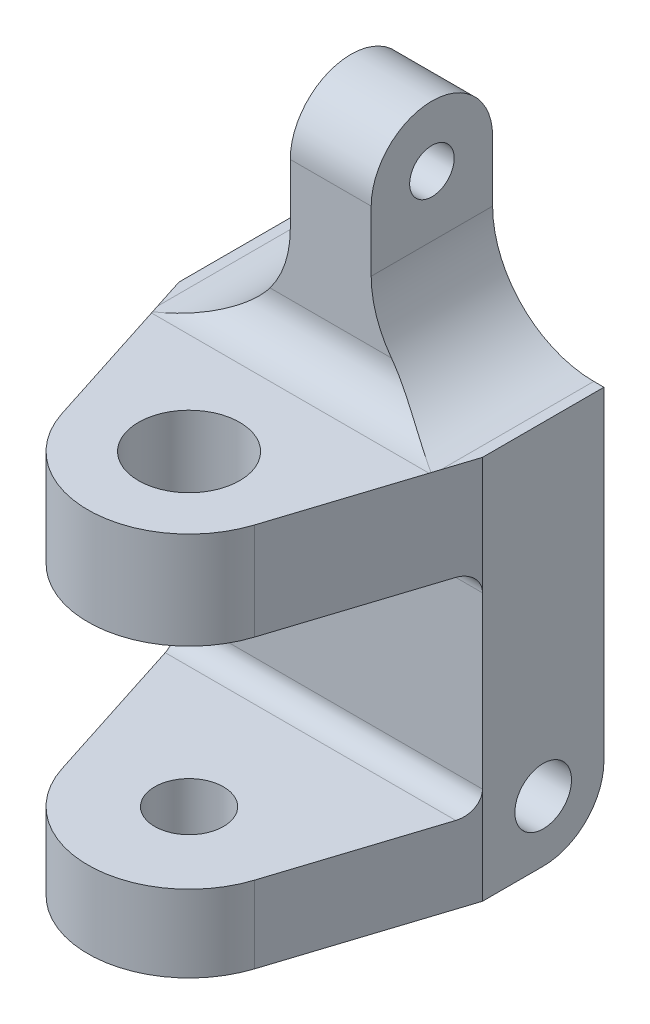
from build123d import *

# Parameters (mm, degrees)
BOSS_EXTRUDE1_DEPTH      = 9.525
BOSS_EXTRUDE6_DEPTH      = 15.24
BOSS_EXTRUDE6_DEPTH_BACK = 19.05
CUT_EXTRUDE1_DEPTH       = 29.575
CUT_EXTRUDE1_DEPTH_BACK  = 29.575
SKETCH9_R                = 1.397
SKETCH9_R_2              = 1.778
CUT_EXTRUDE2_DEPTH       = 33.995567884
SKETCH10_R               = 2.159
CUT_EXTRUDE3_DEPTH       = 33.18516778
CUT_EXTRUDE4_DEPTH       = 27.189420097
CUT_EXTRUDE4_DEPTH_BACK  = 27.189420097
SKETCH14_R               = 3.175
CUT_EXTRUDE5_DEPTH       = 5.08
CUT_EXTRUDE6_DEPTH       = 1.27


with BuildPart() as part:
    # Sketch1 → Boss-Extrude1 (new, symmetric)
    with BuildSketch(Plane(origin=(0, 0, 0), x_dir=(0, 0, -1), z_dir=(1, 0, 0))):
        with BuildLine():
            Line((3.81, 15.24), (3.81, -15.24))
            ThreePointArc((3.81, -15.24), (0, -19.05), (-3.81, -15.24))
            Line((-3.81, -15.24), (-3.81, 15.24))
            ThreePointArc((-3.81, 15.24), (0, 19.05), (3.81, 15.24))
        make_face()
    extrude(amount=BOSS_EXTRUDE1_DEPTH, both=True)

    # Sketch7 → Boss-Extrude6 (add, two sides: drawn at the far end of the back side and taken through both)
    with BuildSketch(Plane(origin=(0, 0, 0), x_dir=(1, 0, 0), z_dir=(0, 1, 0)).offset(-BOSS_EXTRUDE6_DEPTH_BACK)):
        with BuildLine():
            Line((9.525, -3.81), (6.045782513, -14.641909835))
            ThreePointArc((6.045782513, -14.641909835), (3.741080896, -17.830966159), (0, -19.05))
            ThreePointArc((0, -19.05), (-3.741080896, -17.830966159), (-6.045782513, -14.641909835))
            Line((-6.045782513, -14.641909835), (-9.525, -3.81))
            Line((-9.525, -3.81), (-9.525, 0))
            Line((-9.525, 0), (9.525, 0))
            Line((9.525, 0), (9.525, -3.81))
        make_face()
    extrude(amount=BOSS_EXTRUDE6_DEPTH + BOSS_EXTRUDE6_DEPTH_BACK)

    # Sketch8 → Cut-Extrude1 (cut, two sides: drawn at the far end of the back side and taken through both)
    with BuildSketch(Plane(origin=(0, 0, 0), x_dir=(0, 0, -1), z_dir=(1, 0, 0)).offset(-CUT_EXTRUDE1_DEPTH_BACK)):
        with BuildLine():
            Line((-38.102695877, -14.224), (-5.08, -14.224))
            ThreePointArc((-5.08, -14.224), (-4.181974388, -13.852025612), (-3.81, -12.954))
            Line((-3.81, -12.954), (-3.81, -2.286))
            ThreePointArc((-3.81, -2.286), (-4.181974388, -1.387974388), (-5.08, -1.016))
            Line((-5.08, -1.016), (-38.102695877, -1.016))
            Line((-38.102695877, -1.016), (-38.102695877, -14.224))
        make_face()
        with BuildLine():
            Line((-38.102695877, 5.08), (-6.35, 5.08))
            ThreePointArc((-6.35, 5.08), (-4.553948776, 5.823948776), (-3.81, 7.62))
            Line((-3.81, 7.62), (-3.81, 18.584898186))
            Line((-3.81, 18.584898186), (-38.102695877, 18.584898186))
            Line((-38.102695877, 18.584898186), (-38.102695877, 5.08))
        make_face()
    extrude(amount=CUT_EXTRUDE1_DEPTH + CUT_EXTRUDE1_DEPTH_BACK, mode=Mode.SUBTRACT)

    # Sketch9 → Cut-Extrude2 (cut, through all)
    with BuildSketch(Plane.ZY.offset(9.525)):
        with Locations((0, 15.24)):
            Circle(SKETCH9_R)
        with Locations((0, -15.24)):
            Circle(SKETCH9_R_2)
    extrude(amount=-CUT_EXTRUDE2_DEPTH, mode=Mode.SUBTRACT)

    # Sketch10 → Cut-Extrude3 (cut, through all)
    with BuildSketch(Plane(origin=(0, 5.08, 0), x_dir=(1, 0, 0), z_dir=(0, 1, 0))):
        with Locations(Location((0, -12.7, 0), (0, 0, 270))):
            Circle(SKETCH10_R)
    extrude(amount=-CUT_EXTRUDE3_DEPTH, mode=Mode.SUBTRACT)

    # Sketch13 → Cut-Extrude4 (cut, two sides: drawn at the far end of the back side and taken through both)
    with BuildSketch(Plane.XY.offset(3.81).offset(-CUT_EXTRUDE4_DEPTH_BACK)):
        with BuildLine():
            Line((-2.54, 19.05), (-2.54, 11.43))
            ThreePointArc((-2.54, 11.43), (-4.399871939, 6.939871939), (-8.89, 5.08))
            Line((-8.89, 5.08), (-10.957716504, 5.08))
            Line((-10.957716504, 5.08), (-10.957716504, 19.05))
            Line((-10.957716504, 19.05), (-2.54, 19.05))
        make_face()
        with BuildLine():
            Line((10.957716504, 19.05), (2.54, 19.05))
            Line((2.54, 19.05), (2.54, 11.43))
            ThreePointArc((2.54, 11.43), (4.399871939, 6.939871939), (8.89, 5.08))
            Line((8.89, 5.08), (10.957716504, 5.08))
            Line((10.957716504, 5.08), (10.957716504, 19.05))
        make_face()
    extrude(amount=CUT_EXTRUDE4_DEPTH + CUT_EXTRUDE4_DEPTH_BACK, mode=Mode.SUBTRACT)

    # Sketch14 → Cut-Extrude5 (cut)
    with BuildSketch(Plane(origin=(0, 5.08, 0), x_dir=(1, 0, 0), z_dir=(0, 1, 0))):
        with Locations(Location((0, -12.7, 0), (0, 0, 270))):
            Circle(SKETCH14_R)
    extrude(amount=-CUT_EXTRUDE5_DEPTH, mode=Mode.SUBTRACT)

    # Sketch15 → Cut-Extrude6 (cut)
    with BuildSketch(Plane.XZ.offset(19.05)):
        Polygon((0, 7.567356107), (4.445, 10.133678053), (4.445, 15.266321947), (0, 17.832643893), (-4.445, 15.266321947), (-4.445, 10.133678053), align=None)
    extrude(amount=-CUT_EXTRUDE6_DEPTH, mode=Mode.SUBTRACT)


solid = part.part
